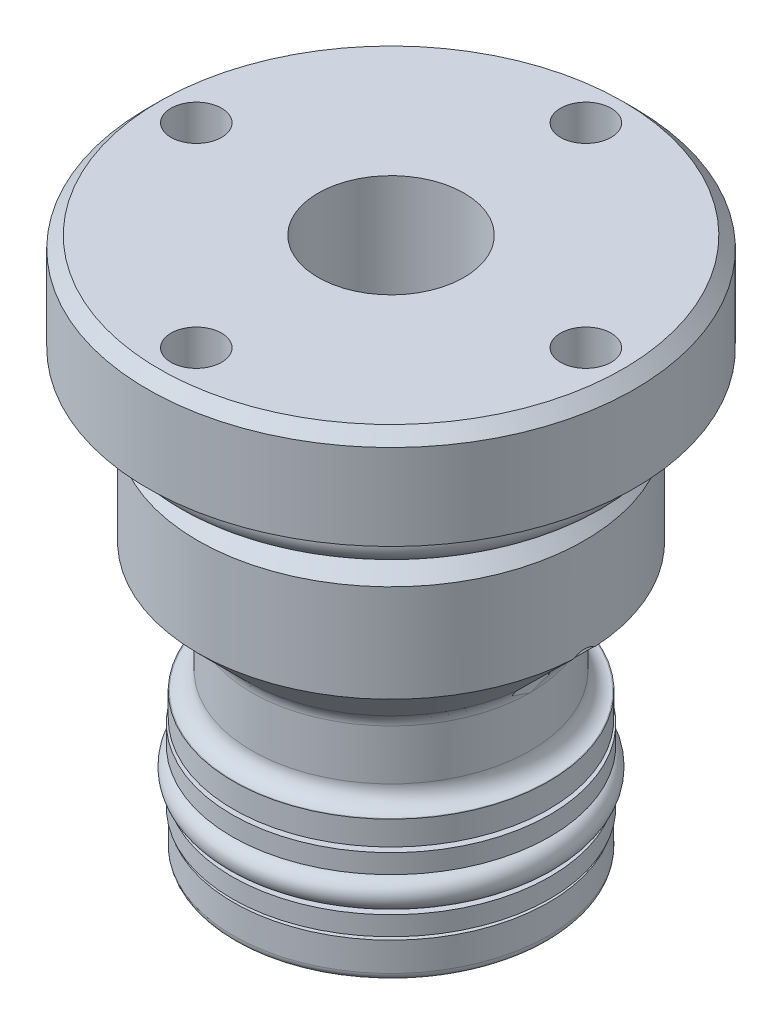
from build123d import *

# Parameters (mm, degrees)
FILLET1_R               = 1.143
FILLET2_R               = 0.381
FILLET3_R               = 0.508
CIRPATTERN1_COUNT       = 4
CHAMFER1_SIZE           = 0.762000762
FILLET4_R               = 0.381
SKETCH5_R               = 1.3081
SKETCH6_R               = 0.889
SKETCH6_W               = 1.3462
SKETCH6_H               = 1.2446
CUT_EXTRUDE1_DEPTH      = 42.518512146
CUT_EXTRUDE1_DEPTH_BACK = 42.518512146
SKETCH7_R               = 1.1811
CUT_EXTRUDE3_START      = 9.0805
CUT_EXTRUDE3_DEPTH      = 25.4


with BuildPart() as part:
    # Sketch1 → Revolve1 (revolve)
    with BuildSketch(Plane.XY, mode=Mode.PRIVATE) as revolve1_sk:
        Polygon((-7.9375, 0), (-7.9375, 18.2372), (-4.7625, 18.2372), (-4.7625, 34.925), (-15.874999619, 34.925), (-15.874999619, 28.575), (-12.6111, 28.575), (-12.6111, 17.6403), (-9.0805, 14.1097), (-9.0805, 9.2202), (-10.2743, 9.2202), (-10.2743, 7.6454), (-9.017, 7.6454), (-9.017, 2.3876), (-10.2743, 2.3876), (-10.2743, 0), align=None)
    revolve(revolve1_sk.sketch.rotate(Axis((0, 0, 0), (0, 1, 0)), 270), axis=Axis((0, 0, 0), (0, 1, 0)))

    # Fillet1
    fillet1_edges = [part.edges().sort_by_distance(p)[0] for p in [
        (0, 9.2202, 9.0805),
        (0, 14.1097, 9.0805),
    ]]
    fillet(fillet1_edges, radius=FILLET1_R)

    # Fillet2
    fillet2_edges = [part.edges().sort_by_distance(p)[0] for p in [
        (0, 2.3876, 9.017),
        (0, 7.6454, 9.017),
    ]]
    fillet(fillet2_edges, radius=FILLET2_R)

    # Fillet3
    fillet3_edges = [part.edges().sort_by_distance(p)[0] for p in [
        (0, 0, 10.2743),
    ]]
    fillet(fillet3_edges, radius=FILLET3_R)

    # Sketch2 → Hole1 (revolve, cut)
    with BuildSketch(Plane(origin=(12.7, 34.925, 0), x_dir=(0, 0, 1), z_dir=(1, 0, 0))):
        Polygon((0, 0), (0, 4.167020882), (1.651, 3.175), (1.651, 0), align=None)
    hole1 = revolve(axis=Axis((12.7, 39.169199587, 0), (0, -1, 0)), mode=Mode.SUBTRACT)

    # CirPattern1: Hole1 ×4 about axis
    cirpattern1_axis = Axis((0, 0, 0), (0, 1, 0))
    for i in range(1, CIRPATTERN1_COUNT):
        add(hole1.rotate(cirpattern1_axis, i * 360 / CIRPATTERN1_COUNT), mode=Mode.SUBTRACT)

    # Chamfer1
    chamfer1_edges = [part.edges().sort_by_distance(p)[0] for p in [
        (0, 34.925, 15.874999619),
    ]]
    chamfer(chamfer1_edges, length=CHAMFER1_SIZE)

    # Sketch4 → Cut-Revolve1 (revolve, cut)
    with BuildSketch(Plane.XY, mode=Mode.PRIVATE) as cut_revolve1_sk:
        Polygon((-12.6111, 28.575), (-12.6111, 23.9903), (-11.4808, 25.1206), (-11.4808, 28.575), align=None)
    revolve(cut_revolve1_sk.sketch.rotate(Axis((0, 0, 0), (0, 1, 0)), 270), axis=Axis((0, 0, 0), (0, 1, 0)), mode=Mode.SUBTRACT)

    # Fillet4
    fillet4_edges = [part.edges().sort_by_distance(p)[0] for p in [
        (0, 28.575, 11.4808),
        (0, 25.1206, 11.4808),
    ]]
    fillet(fillet4_edges, radius=FILLET4_R)

    # Sketch5 → Revolve2 (revolve)
    with BuildSketch(Plane.XY, mode=Mode.PRIVATE) as revolve2_sk:
        with Locations((-12.7508, 27.2288)):
            Circle(SKETCH5_R)
    revolve(revolve2_sk.sketch.rotate(Axis((0, 0, 0), (0, 1, 0)), 270), axis=Axis((0, 0, 0), (0, 1, 0)))

    # Sketch6 → Revolve3 (revolve)
    with BuildSketch(Plane.XY, mode=Mode.PRIVATE) as revolve3_sk:
        with Locations((-9.8552, 4.9276)):
            Circle(SKETCH6_R)
        with Locations((-9.6901, 6.7691)):
            Rectangle(SKETCH6_W, SKETCH6_H)
        with Locations((-9.6901, 3.2639)):
            Rectangle(SKETCH6_W, SKETCH6_H)
    revolve(revolve3_sk.sketch.rotate(Axis((0, 0, 0), (0, 1, 0)), 270), axis=Axis((0, 0, 0), (0, 1, 0)))

    # Sketch7 → Cut-Extrude1 (cut, two sides: drawn at the far end of the back side and taken through both)
    with BuildSketch(Plane(origin=(0, 0, 0), x_dir=(0, 0, -1), z_dir=(1, 0, 0)).offset(-CUT_EXTRUDE1_DEPTH_BACK)):
        with Locations((0, 16.6878)):
            Circle(SKETCH7_R)
    extrude(amount=CUT_EXTRUDE1_DEPTH + CUT_EXTRUDE1_DEPTH_BACK, mode=Mode.SUBTRACT)

    # Sketch8 → Cut-Extrude3 (cut)
    with BuildSketch(Plane(origin=(0, 0, 0), x_dir=(0, 0, -1), z_dir=(1, 0, 0)).offset(CUT_EXTRUDE3_START)):
        with BuildLine():
            Line((-1.1811, 16.6878), (-1.1811, 11.9253))
            ThreePointArc((-1.1811, 11.9253), (0, 10.7442), (1.1811, 11.9253))
            Line((1.1811, 11.9253), (1.1811, 16.6878))
            ThreePointArc((1.1811, 16.6878), (0, 17.8689), (-1.1811, 16.6878))
        make_face()
    cut_extrude3 = extrude(amount=CUT_EXTRUDE3_DEPTH, mode=Mode.SUBTRACT)

    # Mirror1: Cut-Extrude3 across plane
    add(cut_extrude3.mirror(Plane(origin=(0, 0, 0), x_dir=(0, 0, 1), z_dir=(1, 0, 0))), mode=Mode.SUBTRACT)


solid = part.part
